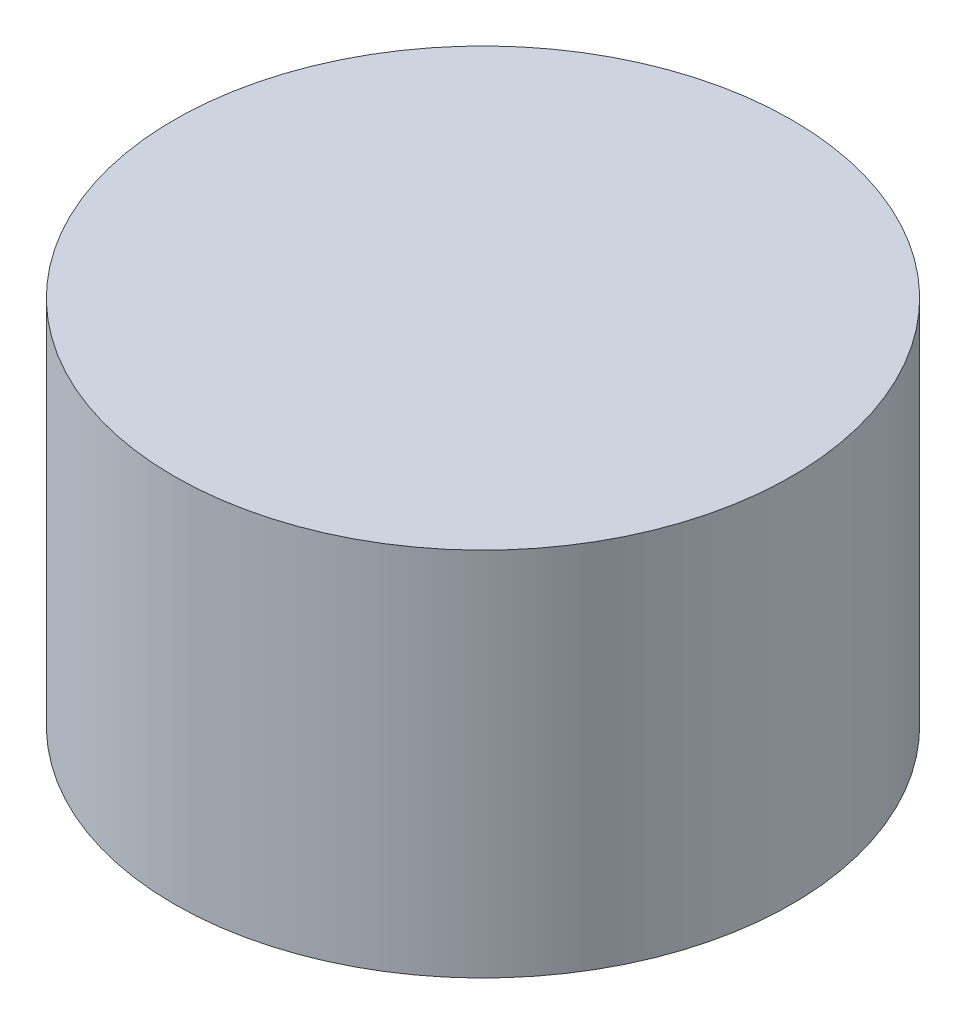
from build123d import *

# Parameters (mm, degrees)
SKETCH1_R           = 25
BOSS_EXTRUDE1_DEPTH = 30


with BuildPart() as part:
    # Sketch1 → Boss-Extrude1 (new body)
    with BuildSketch(Plane(origin=(0, 0, 0), x_dir=(1, 0, 0), z_dir=(0, 1, 0))):
        with Locations(Location((0, 0, 0), (0, 0, 270))):
            Circle(SKETCH1_R)
    extrude(amount=BOSS_EXTRUDE1_DEPTH)


solid = part.part
